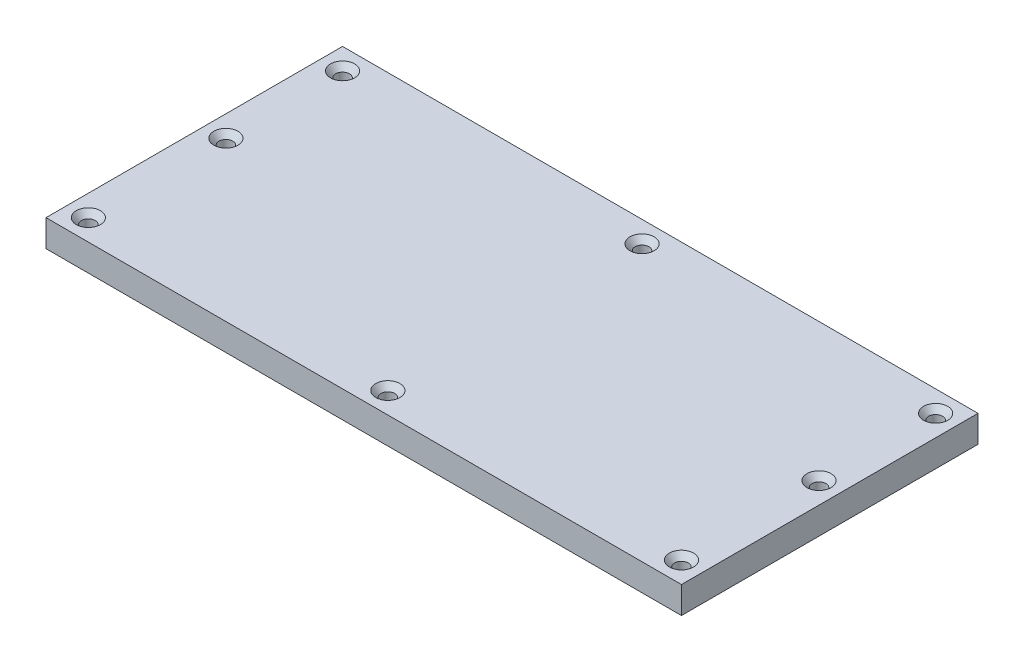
from build123d import *

# Parameters (mm, degrees)
SKETCH2_W                                      = 150
SKETCH2_H                                      = 70
BOSS_EXTRUDE1_DEPTH                            = 6.35
CSK_FOR_4_FLAT_HEAD_MACHINE_SCREW1_D           = 3.2639
CSK_FOR_4_FLAT_HEAD_MACHINE_SCREW1_CSINK_D     = 5.715
CSK_FOR_4_FLAT_HEAD_MACHINE_SCREW1_CSINK_ANGLE = 82


with BuildPart() as part:
    # Sketch2 → Boss-Extrude1 (new body)
    with BuildSketch(Plane(origin=(0, 0, 0), x_dir=(1, 0, 0), z_dir=(0, 1, 0))):
        Rectangle(SKETCH2_W, SKETCH2_H)
    extrude(amount=BOSS_EXTRUDE1_DEPTH)

    # CSK for _4 Flat Head Machine Screw1 (through all)
    with Locations(Plane(origin=(-70, 6.35, -30), x_dir=(0, 0, 1), z_dir=(0, 1, 0))):
        with Locations((0, 0), (0, 70.694282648), (0, 140), (27.530351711, 140), (60, 140), (60, 70.694282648), (60, 0), (27.530351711, 0)):
            CounterSinkHole(CSK_FOR_4_FLAT_HEAD_MACHINE_SCREW1_D / 2, CSK_FOR_4_FLAT_HEAD_MACHINE_SCREW1_CSINK_D / 2, counter_sink_angle=CSK_FOR_4_FLAT_HEAD_MACHINE_SCREW1_CSINK_ANGLE)


solid = part.part
